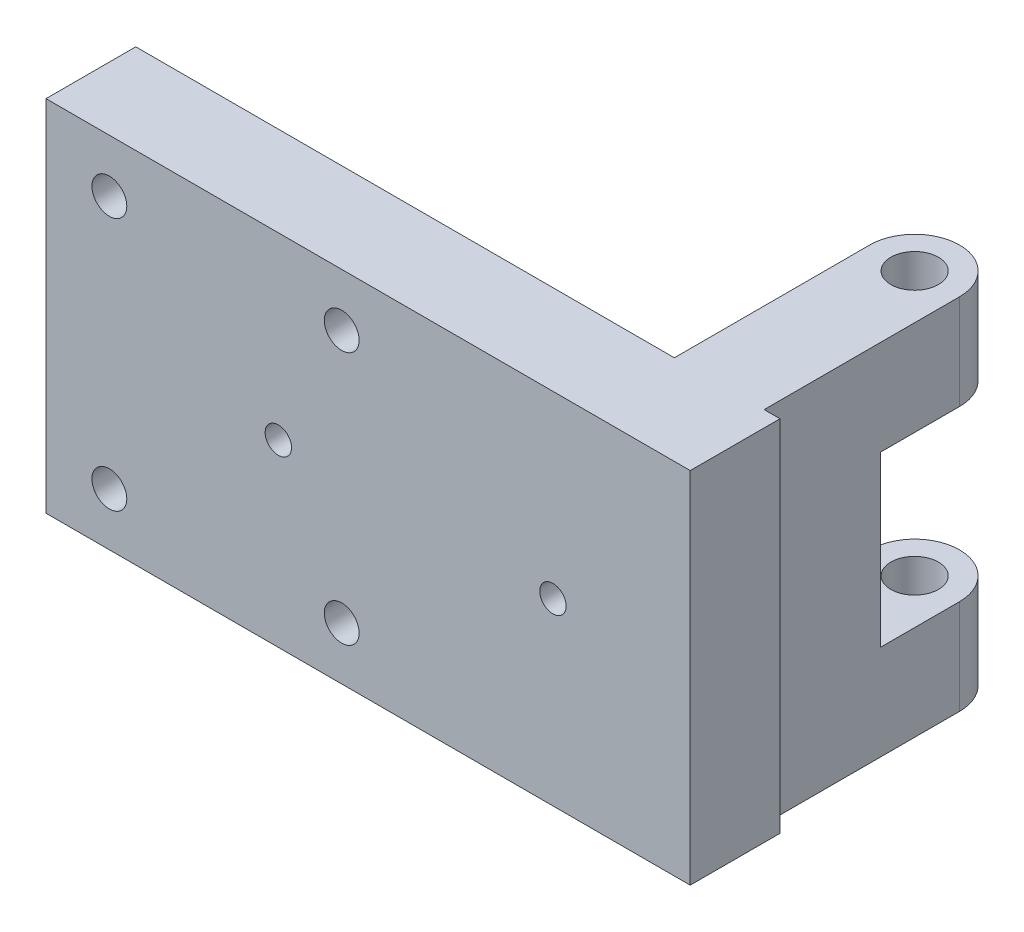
ISO-10303-21;
HEADER;
FILE_DESCRIPTION(('STEP AP214'),'2;1');
FILE_NAME('part.step','',(''),(''),'','','');
FILE_SCHEMA(('AUTOMOTIVE_DESIGN { 1 0 10303 214 1 1 1 1 }'));
ENDSEC;
DATA;
#1=APPLICATION_CONTEXT('core data for automotive mechanical design processes');
#2=APPLICATION_PROTOCOL_DEFINITION('international standard','automotive_design',2000,#1);
#3=PRODUCT_CONTEXT('',#1,'mechanical');
#4=PRODUCT('Part','Part','',(#3));
#5=PRODUCT_RELATED_PRODUCT_CATEGORY('part','',(#4));
#6=PRODUCT_DEFINITION_FORMATION('','',#4);
#7=PRODUCT_DEFINITION_CONTEXT('part definition',#1,'design');
#8=PRODUCT_DEFINITION('design','',#6,#7);
#9=PRODUCT_DEFINITION_SHAPE('','',#8);
#10=(LENGTH_UNIT() NAMED_UNIT(*) SI_UNIT(.MILLI.,.METRE.));
#11=(NAMED_UNIT(*) PLANE_ANGLE_UNIT() SI_UNIT($,.RADIAN.));
#12=(NAMED_UNIT(*) SI_UNIT($,.STERADIAN.) SOLID_ANGLE_UNIT());
#13=UNCERTAINTY_MEASURE_WITH_UNIT(LENGTH_MEASURE(1.E-05),#10,'distance_accuracy_value','');
#14=(GEOMETRIC_REPRESENTATION_CONTEXT(3) GLOBAL_UNCERTAINTY_ASSIGNED_CONTEXT((#13)) GLOBAL_UNIT_ASSIGNED_CONTEXT((#10,
#11,#12)) REPRESENTATION_CONTEXT('',''));
#15=CARTESIAN_POINT('',(0.,0.,0.));
#16=DIRECTION('',(0.,0.,1.));
#17=DIRECTION('',(1.,0.,0.));
#18=AXIS2_PLACEMENT_3D('',#15,#16,#17);
#19=CARTESIAN_POINT('',(0.,68.,0.));
#20=DIRECTION('',(0.,0.,-1.));
#21=DIRECTION('',(-1.,0.,0.));
#22=AXIS2_PLACEMENT_3D('',#19,#20,#21);
#23=PLANE('',#22);
#24=CARTESIAN_POINT('',(44.,34.,0.));
#25=DIRECTION('',(0.,0.,1.));
#26=DIRECTION('',(1.,0.,0.));
#27=AXIS2_PLACEMENT_3D('',#24,#25,#26);
#28=CIRCLE('',#27,2.5);
#29=CARTESIAN_POINT('',(46.5,34.,0.));
#30=VERTEX_POINT('',#29);
#31=EDGE_CURVE('E186',#30,#30,#28,.T.);
#32=ORIENTED_EDGE('',*,*,#31,.T.);
#33=EDGE_LOOP('',(#32));
#34=FACE_BOUND('',#33,.T.);
#35=CARTESIAN_POINT('',(96.,34.,0.));
#36=DIRECTION('',(0.,0.,1.));
#37=DIRECTION('',(1.,0.,0.));
#38=AXIS2_PLACEMENT_3D('',#35,#36,#37);
#39=CIRCLE('',#38,2.5);
#40=CARTESIAN_POINT('',(98.5,34.,0.));
#41=VERTEX_POINT('',#40);
#42=EDGE_CURVE('E307',#41,#41,#39,.T.);
#43=ORIENTED_EDGE('',*,*,#42,.T.);
#44=EDGE_LOOP('',(#43));
#45=FACE_BOUND('',#44,.T.);
#46=CARTESIAN_POINT('',(12.,58.,0.));
#47=DIRECTION('',(0.,0.,1.));
#48=DIRECTION('',(1.,0.,0.));
#49=AXIS2_PLACEMENT_3D('',#46,#47,#48);
#50=CIRCLE('',#49,3.3);
#51=CARTESIAN_POINT('',(15.3,58.,0.));
#52=VERTEX_POINT('',#51);
#53=EDGE_CURVE('E301',#52,#52,#50,.T.);
#54=ORIENTED_EDGE('',*,*,#53,.T.);
#55=EDGE_LOOP('',(#54));
#56=FACE_BOUND('',#55,.T.);
#57=CARTESIAN_POINT('',(56.,58.,0.));
#58=DIRECTION('',(0.,0.,1.));
#59=DIRECTION('',(1.,0.,0.));
#60=AXIS2_PLACEMENT_3D('',#57,#58,#59);
#61=CIRCLE('',#60,3.3);
#62=CARTESIAN_POINT('',(59.3,58.,0.));
#63=VERTEX_POINT('',#62);
#64=EDGE_CURVE('E295',#63,#63,#61,.T.);
#65=ORIENTED_EDGE('',*,*,#64,.T.);
#66=EDGE_LOOP('',(#65));
#67=FACE_BOUND('',#66,.T.);
#68=CARTESIAN_POINT('',(56.,10.,0.));
#69=DIRECTION('',(0.,0.,1.));
#70=DIRECTION('',(1.,0.,0.));
#71=AXIS2_PLACEMENT_3D('',#68,#69,#70);
#72=CIRCLE('',#71,3.3);
#73=CARTESIAN_POINT('',(59.3,10.,0.));
#74=VERTEX_POINT('',#73);
#75=EDGE_CURVE('E289',#74,#74,#72,.T.);
#76=ORIENTED_EDGE('',*,*,#75,.T.);
#77=EDGE_LOOP('',(#76));
#78=FACE_BOUND('',#77,.T.);
#79=CARTESIAN_POINT('',(12.,10.,0.));
#80=DIRECTION('',(0.,0.,1.));
#81=DIRECTION('',(1.,0.,0.));
#82=AXIS2_PLACEMENT_3D('',#79,#80,#81);
#83=CIRCLE('',#82,3.3);
#84=CARTESIAN_POINT('',(15.3,10.,0.));
#85=VERTEX_POINT('',#84);
#86=EDGE_CURVE('E283',#85,#85,#83,.T.);
#87=ORIENTED_EDGE('',*,*,#86,.T.);
#88=EDGE_LOOP('',(#87));
#89=FACE_BOUND('',#88,.T.);
#90=DIRECTION('',(-1.,0.,0.));
#91=VECTOR('',#90,1.);
#92=CARTESIAN_POINT('',(0.,68.,0.));
#93=LINE('',#92,#91);
#94=CARTESIAN_POINT('',(102.,68.,0.));
#95=VERTEX_POINT('',#94);
#96=CARTESIAN_POINT('',(0.,68.,0.));
#97=VERTEX_POINT('',#96);
#98=EDGE_CURVE('E225',#95,#97,#93,.T.);
#99=ORIENTED_EDGE('',*,*,#98,.F.);
#100=DIRECTION('',(0.,-1.,0.));
#101=VECTOR('',#100,1.);
#102=CARTESIAN_POINT('',(102.,18.,0.));
#103=LINE('',#102,#101);
#104=CARTESIAN_POINT('',(102.,0.,0.));
#105=VERTEX_POINT('',#104);
#106=EDGE_CURVE('E175',#95,#105,#103,.T.);
#107=ORIENTED_EDGE('',*,*,#106,.T.);
#108=DIRECTION('',(1.,0.,0.));
#109=VECTOR('',#108,1.);
#110=CARTESIAN_POINT('',(0.,0.,0.));
#111=LINE('',#110,#109);
#112=CARTESIAN_POINT('',(0.,0.,0.));
#113=VERTEX_POINT('',#112);
#114=EDGE_CURVE('E212',#113,#105,#111,.T.);
#115=ORIENTED_EDGE('',*,*,#114,.F.);
#116=DIRECTION('',(0.,-1.,0.));
#117=VECTOR('',#116,1.);
#118=CARTESIAN_POINT('',(0.,0.,0.));
#119=LINE('',#118,#117);
#120=EDGE_CURVE('E213',#97,#113,#119,.T.);
#121=ORIENTED_EDGE('',*,*,#120,.F.);
#122=EDGE_LOOP('',(#99,#107,#115,#121));
#123=FACE_BOUND('',#122,.T.);
#124=ADVANCED_FACE('F30',(#34,#45,#56,#67,#78,#89,#123),#23,.T.);
#125=DIRECTION('',(0.,-1.,0.));
#126=VECTOR('',#125,1.);
#127=CARTESIAN_POINT('',(119.,18.,0.));
#128=LINE('',#127,#126);
#129=CARTESIAN_POINT('',(119.,68.,0.));
#130=VERTEX_POINT('',#129);
#131=CARTESIAN_POINT('',(119.,0.,0.));
#132=VERTEX_POINT('',#131);
#133=EDGE_CURVE('E181',#130,#132,#128,.T.);
#134=ORIENTED_EDGE('',*,*,#133,.F.);
#135=CARTESIAN_POINT('',(122.,68.,0.));
#136=VERTEX_POINT('',#135);
#137=EDGE_CURVE('E226',#136,#130,#93,.T.);
#138=ORIENTED_EDGE('',*,*,#137,.F.);
#139=DIRECTION('',(0.,1.,0.));
#140=VECTOR('',#139,1.);
#141=CARTESIAN_POINT('',(122.,0.,0.));
#142=LINE('',#141,#140);
#143=CARTESIAN_POINT('',(122.,0.,0.));
#144=VERTEX_POINT('',#143);
#145=EDGE_CURVE('E211',#144,#136,#142,.T.);
#146=ORIENTED_EDGE('',*,*,#145,.F.);
#147=EDGE_CURVE('E203',#132,#144,#111,.T.);
#148=ORIENTED_EDGE('',*,*,#147,.F.);
#149=EDGE_LOOP('',(#134,#138,#146,#148));
#150=FACE_BOUND('',#149,.T.);
#151=ADVANCED_FACE('F209',(#150),#23,.T.);
#152=CARTESIAN_POINT('',(0.,0.,17.));
#153=DIRECTION('',(1.,0.,0.));
#154=DIRECTION('',(0.,0.,-1.));
#155=AXIS2_PLACEMENT_3D('',#152,#153,#154);
#156=PLANE('',#155);
#157=ORIENTED_EDGE('',*,*,#120,.T.);
#158=DIRECTION('',(0.,0.,-1.));
#159=VECTOR('',#158,1.);
#160=CARTESIAN_POINT('',(0.,0.,17.));
#161=LINE('',#160,#159);
#162=CARTESIAN_POINT('',(0.,0.,17.));
#163=VERTEX_POINT('',#162);
#164=EDGE_CURVE('E11',#163,#113,#161,.T.);
#165=ORIENTED_EDGE('',*,*,#164,.F.);
#166=DIRECTION('',(0.,-1.,0.));
#167=VECTOR('',#166,1.);
#168=CARTESIAN_POINT('',(0.,0.,17.));
#169=LINE('',#168,#167);
#170=CARTESIAN_POINT('',(0.,68.,17.));
#171=VERTEX_POINT('',#170);
#172=EDGE_CURVE('E229',#171,#163,#169,.T.);
#173=ORIENTED_EDGE('',*,*,#172,.F.);
#174=DIRECTION('',(0.,0.,-1.));
#175=VECTOR('',#174,1.);
#176=CARTESIAN_POINT('',(0.,68.,17.));
#177=LINE('',#176,#175);
#178=EDGE_CURVE('E230',#171,#97,#177,.T.);
#179=ORIENTED_EDGE('',*,*,#178,.T.);
#180=EDGE_LOOP('',(#157,#165,#173,#179));
#181=FACE_BOUND('',#180,.T.);
#182=ADVANCED_FACE('F32',(#181),#156,.F.);
#183=CARTESIAN_POINT('',(0.,0.,17.));
#184=DIRECTION('',(0.,1.,0.));
#185=DIRECTION('',(0.,0.,1.));
#186=AXIS2_PLACEMENT_3D('',#183,#184,#185);
#187=PLANE('',#186);
#188=ORIENTED_EDGE('',*,*,#114,.T.);
#189=DIRECTION('',(0.,0.,-1.));
#190=VECTOR('',#189,1.);
#191=CARTESIAN_POINT('',(102.,0.,0.));
#192=LINE('',#191,#190);
#193=CARTESIAN_POINT('',(102.,0.,-37.));
#194=VERTEX_POINT('',#193);
#195=EDGE_CURVE('E165',#105,#194,#192,.T.);
#196=ORIENTED_EDGE('',*,*,#195,.T.);
#197=CARTESIAN_POINT('',(110.5,0.,-37.));
#198=DIRECTION('',(0.,-1.,0.));
#199=DIRECTION('',(0.,0.,1.));
#200=AXIS2_PLACEMENT_3D('',#197,#198,#199);
#201=CIRCLE('',#200,8.49999999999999);
#202=CARTESIAN_POINT('',(119.,0.,-37.));
#203=VERTEX_POINT('',#202);
#204=EDGE_CURVE('E176',#194,#203,#201,.T.);
#205=ORIENTED_EDGE('',*,*,#204,.T.);
#206=DIRECTION('',(0.,0.,1.));
#207=VECTOR('',#206,1.);
#208=CARTESIAN_POINT('',(119.,0.,0.));
#209=LINE('',#208,#207);
#210=EDGE_CURVE('E170',#203,#132,#209,.T.);
#211=ORIENTED_EDGE('',*,*,#210,.T.);
#212=ORIENTED_EDGE('',*,*,#147,.T.);
#213=DIRECTION('',(0.,0.,-1.));
#214=VECTOR('',#213,1.);
#215=CARTESIAN_POINT('',(122.,0.,17.));
#216=LINE('',#215,#214);
#217=CARTESIAN_POINT('',(122.,0.,17.));
#218=VERTEX_POINT('',#217);
#219=EDGE_CURVE('E39',#218,#144,#216,.T.);
#220=ORIENTED_EDGE('',*,*,#219,.F.);
#221=DIRECTION('',(1.,0.,0.));
#222=VECTOR('',#221,1.);
#223=CARTESIAN_POINT('',(0.,0.,17.));
#224=LINE('',#223,#222);
#225=EDGE_CURVE('E242',#163,#218,#224,.T.);
#226=ORIENTED_EDGE('',*,*,#225,.F.);
#227=ORIENTED_EDGE('',*,*,#164,.T.);
#228=EDGE_LOOP('',(#188,#196,#205,#211,#212,#220,#226,#227));
#229=FACE_BOUND('',#228,.T.);
#230=CARTESIAN_POINT('',(110.5,0.,-37.));
#231=DIRECTION('',(0.,-1.,0.));
#232=DIRECTION('',(0.,0.,-1.));
#233=AXIS2_PLACEMENT_3D('',#230,#231,#232);
#234=CIRCLE('',#233,4.50000000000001);
#235=CARTESIAN_POINT('',(110.5,0.,-41.5));
#236=VERTEX_POINT('',#235);
#237=EDGE_CURVE('E160',#236,#236,#234,.T.);
#238=ORIENTED_EDGE('',*,*,#237,.F.);
#239=EDGE_LOOP('',(#238));
#240=FACE_BOUND('',#239,.T.);
#241=ADVANCED_FACE('F200',(#229,#240),#187,.F.);
#242=CARTESIAN_POINT('',(122.,0.,17.));
#243=DIRECTION('',(-1.,0.,0.));
#244=DIRECTION('',(0.,0.,1.));
#245=AXIS2_PLACEMENT_3D('',#242,#243,#244);
#246=PLANE('',#245);
#247=ORIENTED_EDGE('',*,*,#145,.T.);
#248=DIRECTION('',(0.,0.,-1.));
#249=VECTOR('',#248,1.);
#250=CARTESIAN_POINT('',(122.,68.,17.));
#251=LINE('',#250,#249);
#252=CARTESIAN_POINT('',(122.,68.,17.));
#253=VERTEX_POINT('',#252);
#254=EDGE_CURVE('E233',#253,#136,#251,.T.);
#255=ORIENTED_EDGE('',*,*,#254,.F.);
#256=DIRECTION('',(0.,1.,0.));
#257=VECTOR('',#256,1.);
#258=CARTESIAN_POINT('',(122.,0.,17.));
#259=LINE('',#258,#257);
#260=EDGE_CURVE('E241',#218,#253,#259,.T.);
#261=ORIENTED_EDGE('',*,*,#260,.F.);
#262=ORIENTED_EDGE('',*,*,#219,.T.);
#263=EDGE_LOOP('',(#247,#255,#261,#262));
#264=FACE_BOUND('',#263,.T.);
#265=ADVANCED_FACE('F239',(#264),#246,.F.);
#266=CARTESIAN_POINT('',(0.,68.,17.));
#267=DIRECTION('',(0.,-1.,0.));
#268=DIRECTION('',(0.,0.,-1.));
#269=AXIS2_PLACEMENT_3D('',#266,#267,#268);
#270=PLANE('',#269);
#271=ORIENTED_EDGE('',*,*,#137,.T.);
#272=DIRECTION('',(0.,0.,1.));
#273=VECTOR('',#272,1.);
#274=CARTESIAN_POINT('',(119.,68.,0.));
#275=LINE('',#274,#273);
#276=CARTESIAN_POINT('',(119.,68.,-37.));
#277=VERTEX_POINT('',#276);
#278=EDGE_CURVE('E156',#277,#130,#275,.T.);
#279=ORIENTED_EDGE('',*,*,#278,.F.);
#280=CARTESIAN_POINT('',(110.5,68.,-37.));
#281=DIRECTION('',(0.,-1.,0.));
#282=DIRECTION('',(0.,0.,1.));
#283=AXIS2_PLACEMENT_3D('',#280,#281,#282);
#284=CIRCLE('',#283,8.49999999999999);
#285=CARTESIAN_POINT('',(102.,68.,-37.));
#286=VERTEX_POINT('',#285);
#287=EDGE_CURVE('E137',#286,#277,#284,.T.);
#288=ORIENTED_EDGE('',*,*,#287,.F.);
#289=DIRECTION('',(0.,0.,-1.));
#290=VECTOR('',#289,1.);
#291=CARTESIAN_POINT('',(102.,68.,0.));
#292=LINE('',#291,#290);
#293=EDGE_CURVE('E148',#95,#286,#292,.T.);
#294=ORIENTED_EDGE('',*,*,#293,.F.);
#295=ORIENTED_EDGE('',*,*,#98,.T.);
#296=ORIENTED_EDGE('',*,*,#178,.F.);
#297=DIRECTION('',(-1.,0.,0.));
#298=VECTOR('',#297,1.);
#299=CARTESIAN_POINT('',(0.,68.,17.));
#300=LINE('',#299,#298);
#301=EDGE_CURVE('E234',#253,#171,#300,.T.);
#302=ORIENTED_EDGE('',*,*,#301,.F.);
#303=ORIENTED_EDGE('',*,*,#254,.T.);
#304=EDGE_LOOP('',(#271,#279,#288,#294,#295,#296,#302,#303));
#305=FACE_BOUND('',#304,.T.);
#306=CARTESIAN_POINT('',(110.5,68.,-37.));
#307=DIRECTION('',(0.,-1.,0.));
#308=DIRECTION('',(0.,0.,-1.));
#309=AXIS2_PLACEMENT_3D('',#306,#307,#308);
#310=CIRCLE('',#309,4.50000000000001);
#311=CARTESIAN_POINT('',(110.5,68.,-41.5));
#312=VERTEX_POINT('',#311);
#313=EDGE_CURVE('E152',#312,#312,#310,.T.);
#314=ORIENTED_EDGE('',*,*,#313,.T.);
#315=EDGE_LOOP('',(#314));
#316=FACE_BOUND('',#315,.T.);
#317=ADVANCED_FACE('F278',(#305,#316),#270,.F.);
#318=CARTESIAN_POINT('',(0.,68.,17.));
#319=DIRECTION('',(0.,0.,-1.));
#320=DIRECTION('',(-1.,0.,0.));
#321=AXIS2_PLACEMENT_3D('',#318,#319,#320);
#322=PLANE('',#321);
#323=CARTESIAN_POINT('',(44.,34.,17.));
#324=DIRECTION('',(0.,0.,1.));
#325=DIRECTION('',(1.,0.,0.));
#326=AXIS2_PLACEMENT_3D('',#323,#324,#325);
#327=CIRCLE('',#326,2.49999999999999);
#328=CARTESIAN_POINT('',(46.5,34.,17.));
#329=VERTEX_POINT('',#328);
#330=EDGE_CURVE('E309',#329,#329,#327,.T.);
#331=ORIENTED_EDGE('',*,*,#330,.F.);
#332=EDGE_LOOP('',(#331));
#333=FACE_BOUND('',#332,.T.);
#334=CARTESIAN_POINT('',(96.,34.,17.));
#335=DIRECTION('',(0.,0.,1.));
#336=DIRECTION('',(1.,0.,0.));
#337=AXIS2_PLACEMENT_3D('',#334,#335,#336);
#338=CIRCLE('',#337,2.49999999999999);
#339=CARTESIAN_POINT('',(98.5,34.,17.));
#340=VERTEX_POINT('',#339);
#341=EDGE_CURVE('E304',#340,#340,#338,.T.);
#342=ORIENTED_EDGE('',*,*,#341,.F.);
#343=EDGE_LOOP('',(#342));
#344=FACE_BOUND('',#343,.T.);
#345=CARTESIAN_POINT('',(12.,58.,17.));
#346=DIRECTION('',(0.,0.,1.));
#347=DIRECTION('',(1.,0.,0.));
#348=AXIS2_PLACEMENT_3D('',#345,#346,#347);
#349=CIRCLE('',#348,3.29999999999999);
#350=CARTESIAN_POINT('',(15.3,58.,17.));
#351=VERTEX_POINT('',#350);
#352=EDGE_CURVE('E298',#351,#351,#349,.T.);
#353=ORIENTED_EDGE('',*,*,#352,.F.);
#354=EDGE_LOOP('',(#353));
#355=FACE_BOUND('',#354,.T.);
#356=CARTESIAN_POINT('',(56.,58.,17.));
#357=DIRECTION('',(0.,0.,1.));
#358=DIRECTION('',(1.,0.,0.));
#359=AXIS2_PLACEMENT_3D('',#356,#357,#358);
#360=CIRCLE('',#359,3.29999999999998);
#361=CARTESIAN_POINT('',(59.3,58.,17.));
#362=VERTEX_POINT('',#361);
#363=EDGE_CURVE('E292',#362,#362,#360,.T.);
#364=ORIENTED_EDGE('',*,*,#363,.F.);
#365=EDGE_LOOP('',(#364));
#366=FACE_BOUND('',#365,.T.);
#367=CARTESIAN_POINT('',(56.,10.,17.));
#368=DIRECTION('',(0.,0.,1.));
#369=DIRECTION('',(1.,0.,0.));
#370=AXIS2_PLACEMENT_3D('',#367,#368,#369);
#371=CIRCLE('',#370,3.29999999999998);
#372=CARTESIAN_POINT('',(59.3,10.,17.));
#373=VERTEX_POINT('',#372);
#374=EDGE_CURVE('E286',#373,#373,#371,.T.);
#375=ORIENTED_EDGE('',*,*,#374,.F.);
#376=EDGE_LOOP('',(#375));
#377=FACE_BOUND('',#376,.T.);
#378=CARTESIAN_POINT('',(12.,10.,17.));
#379=DIRECTION('',(0.,0.,1.));
#380=DIRECTION('',(1.,0.,0.));
#381=AXIS2_PLACEMENT_3D('',#378,#379,#380);
#382=CIRCLE('',#381,3.29999999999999);
#383=CARTESIAN_POINT('',(15.3,10.,17.));
#384=VERTEX_POINT('',#383);
#385=EDGE_CURVE('E217',#384,#384,#382,.T.);
#386=ORIENTED_EDGE('',*,*,#385,.F.);
#387=EDGE_LOOP('',(#386));
#388=FACE_BOUND('',#387,.T.);
#389=ORIENTED_EDGE('',*,*,#172,.T.);
#390=ORIENTED_EDGE('',*,*,#225,.T.);
#391=ORIENTED_EDGE('',*,*,#260,.T.);
#392=ORIENTED_EDGE('',*,*,#301,.T.);
#393=EDGE_LOOP('',(#389,#390,#391,#392));
#394=FACE_BOUND('',#393,.T.);
#395=ADVANCED_FACE('F248',(#333,#344,#355,#366,#377,#388,#394),#322,.F.);
#396=CARTESIAN_POINT('',(12.,10.,17.));
#397=DIRECTION('',(0.,0.,1.));
#398=DIRECTION('',(1.,0.,0.));
#399=AXIS2_PLACEMENT_3D('',#396,#397,#398);
#400=CYLINDRICAL_SURFACE('',#399,3.29999999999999);
#401=ORIENTED_EDGE('',*,*,#86,.F.);
#402=EDGE_LOOP('',(#401));
#403=FACE_BOUND('',#402,.T.);
#404=ORIENTED_EDGE('',*,*,#385,.T.);
#405=EDGE_LOOP('',(#404));
#406=FACE_BOUND('',#405,.T.);
#407=ADVANCED_FACE('F463',(#403,#406),#400,.F.);
#408=CARTESIAN_POINT('',(56.,10.,17.));
#409=DIRECTION('',(0.,0.,1.));
#410=DIRECTION('',(1.,0.,0.));
#411=AXIS2_PLACEMENT_3D('',#408,#409,#410);
#412=CYLINDRICAL_SURFACE('',#411,3.29999999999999);
#413=ORIENTED_EDGE('',*,*,#75,.F.);
#414=EDGE_LOOP('',(#413));
#415=FACE_BOUND('',#414,.T.);
#416=ORIENTED_EDGE('',*,*,#374,.T.);
#417=EDGE_LOOP('',(#416));
#418=FACE_BOUND('',#417,.T.);
#419=ADVANCED_FACE('F482',(#415,#418),#412,.F.);
#420=CARTESIAN_POINT('',(56.,58.,17.));
#421=DIRECTION('',(0.,0.,1.));
#422=DIRECTION('',(1.,0.,0.));
#423=AXIS2_PLACEMENT_3D('',#420,#421,#422);
#424=CYLINDRICAL_SURFACE('',#423,3.29999999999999);
#425=ORIENTED_EDGE('',*,*,#64,.F.);
#426=EDGE_LOOP('',(#425));
#427=FACE_BOUND('',#426,.T.);
#428=ORIENTED_EDGE('',*,*,#363,.T.);
#429=EDGE_LOOP('',(#428));
#430=FACE_BOUND('',#429,.T.);
#431=ADVANCED_FACE('F472',(#427,#430),#424,.F.);
#432=CARTESIAN_POINT('',(12.,58.,17.));
#433=DIRECTION('',(0.,0.,1.));
#434=DIRECTION('',(1.,0.,0.));
#435=AXIS2_PLACEMENT_3D('',#432,#433,#434);
#436=CYLINDRICAL_SURFACE('',#435,3.29999999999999);
#437=ORIENTED_EDGE('',*,*,#53,.F.);
#438=EDGE_LOOP('',(#437));
#439=FACE_BOUND('',#438,.T.);
#440=ORIENTED_EDGE('',*,*,#352,.T.);
#441=EDGE_LOOP('',(#440));
#442=FACE_BOUND('',#441,.T.);
#443=ADVANCED_FACE('F327',(#439,#442),#436,.F.);
#444=CARTESIAN_POINT('',(96.,34.,17.));
#445=DIRECTION('',(0.,0.,1.));
#446=DIRECTION('',(1.,0.,0.));
#447=AXIS2_PLACEMENT_3D('',#444,#445,#446);
#448=CYLINDRICAL_SURFACE('',#447,2.5);
#449=ORIENTED_EDGE('',*,*,#42,.F.);
#450=EDGE_LOOP('',(#449));
#451=FACE_BOUND('',#450,.T.);
#452=ORIENTED_EDGE('',*,*,#341,.T.);
#453=EDGE_LOOP('',(#452));
#454=FACE_BOUND('',#453,.T.);
#455=ADVANCED_FACE('F320',(#451,#454),#448,.F.);
#456=CARTESIAN_POINT('',(44.,34.,17.));
#457=DIRECTION('',(0.,0.,1.));
#458=DIRECTION('',(1.,0.,0.));
#459=AXIS2_PLACEMENT_3D('',#456,#457,#458);
#460=CYLINDRICAL_SURFACE('',#459,2.49999999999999);
#461=ORIENTED_EDGE('',*,*,#31,.F.);
#462=EDGE_LOOP('',(#461));
#463=FACE_BOUND('',#462,.T.);
#464=ORIENTED_EDGE('',*,*,#330,.T.);
#465=EDGE_LOOP('',(#464));
#466=FACE_BOUND('',#465,.T.);
#467=ADVANCED_FACE('F318',(#463,#466),#460,.F.);
#468=CARTESIAN_POINT('',(119.,18.,0.));
#469=DIRECTION('',(1.,0.,0.));
#470=DIRECTION('',(0.,0.,-1.));
#471=AXIS2_PLACEMENT_3D('',#468,#469,#470);
#472=PLANE('',#471);
#473=ORIENTED_EDGE('',*,*,#210,.F.);
#474=DIRECTION('',(0.,-1.,0.));
#475=VECTOR('',#474,1.);
#476=CARTESIAN_POINT('',(119.,18.,-37.));
#477=LINE('',#476,#475);
#478=CARTESIAN_POINT('',(119.,18.,-37.));
#479=VERTEX_POINT('',#478);
#480=EDGE_CURVE('E179',#479,#203,#477,.T.);
#481=ORIENTED_EDGE('',*,*,#480,.F.);
#482=DIRECTION('',(0.,0.,1.));
#483=VECTOR('',#482,1.);
#484=CARTESIAN_POINT('',(119.,18.,0.));
#485=LINE('',#484,#483);
#486=CARTESIAN_POINT('',(119.,18.,-22.));
#487=VERTEX_POINT('',#486);
#488=EDGE_CURVE('E173',#479,#487,#485,.T.);
#489=ORIENTED_EDGE('',*,*,#488,.T.);
#490=DIRECTION('',(0.,1.,0.));
#491=VECTOR('',#490,1.);
#492=CARTESIAN_POINT('',(119.,50.,-22.));
#493=LINE('',#492,#491);
#494=CARTESIAN_POINT('',(119.,50.,-22.));
#495=VERTEX_POINT('',#494);
#496=EDGE_CURVE('E147',#487,#495,#493,.T.);
#497=ORIENTED_EDGE('',*,*,#496,.T.);
#498=DIRECTION('',(0.,0.,1.));
#499=VECTOR('',#498,1.);
#500=CARTESIAN_POINT('',(119.,50.,0.));
#501=LINE('',#500,#499);
#502=CARTESIAN_POINT('',(119.,50.,-37.));
#503=VERTEX_POINT('',#502);
#504=EDGE_CURVE('E125',#503,#495,#501,.T.);
#505=ORIENTED_EDGE('',*,*,#504,.F.);
#506=DIRECTION('',(0.,1.,0.));
#507=VECTOR('',#506,1.);
#508=CARTESIAN_POINT('',(119.,50.,-37.));
#509=LINE('',#508,#507);
#510=EDGE_CURVE('E134',#503,#277,#509,.T.);
#511=ORIENTED_EDGE('',*,*,#510,.T.);
#512=ORIENTED_EDGE('',*,*,#278,.T.);
#513=ORIENTED_EDGE('',*,*,#133,.T.);
#514=EDGE_LOOP('',(#473,#481,#489,#497,#505,#511,#512,#513));
#515=FACE_BOUND('',#514,.T.);
#516=ADVANCED_FACE('F145',(#515),#472,.T.);
#517=CARTESIAN_POINT('',(110.5,18.,-37.));
#518=DIRECTION('',(0.,-1.,0.));
#519=DIRECTION('',(0.,0.,-1.));
#520=AXIS2_PLACEMENT_3D('',#517,#518,#519);
#521=CYLINDRICAL_SURFACE('',#520,8.49999999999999);
#522=ORIENTED_EDGE('',*,*,#204,.F.);
#523=DIRECTION('',(0.,-1.,0.));
#524=VECTOR('',#523,1.);
#525=CARTESIAN_POINT('',(102.,18.,-37.));
#526=LINE('',#525,#524);
#527=CARTESIAN_POINT('',(102.,18.,-37.));
#528=VERTEX_POINT('',#527);
#529=EDGE_CURVE('E182',#528,#194,#526,.T.);
#530=ORIENTED_EDGE('',*,*,#529,.F.);
#531=CARTESIAN_POINT('',(110.5,18.,-37.));
#532=DIRECTION('',(0.,-1.,0.));
#533=DIRECTION('',(0.,0.,1.));
#534=AXIS2_PLACEMENT_3D('',#531,#532,#533);
#535=CIRCLE('',#534,8.49999999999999);
#536=EDGE_CURVE('E169',#528,#479,#535,.T.);
#537=ORIENTED_EDGE('',*,*,#536,.T.);
#538=ORIENTED_EDGE('',*,*,#480,.T.);
#539=EDGE_LOOP('',(#522,#530,#537,#538));
#540=FACE_BOUND('',#539,.T.);
#541=ADVANCED_FACE('F261',(#540),#521,.T.);
#542=CARTESIAN_POINT('',(102.,18.,0.));
#543=DIRECTION('',(-1.,0.,0.));
#544=DIRECTION('',(0.,0.,1.));
#545=AXIS2_PLACEMENT_3D('',#542,#543,#544);
#546=PLANE('',#545);
#547=ORIENTED_EDGE('',*,*,#195,.F.);
#548=ORIENTED_EDGE('',*,*,#106,.F.);
#549=ORIENTED_EDGE('',*,*,#293,.T.);
#550=DIRECTION('',(0.,1.,0.));
#551=VECTOR('',#550,1.);
#552=CARTESIAN_POINT('',(102.,50.,-37.));
#553=LINE('',#552,#551);
#554=CARTESIAN_POINT('',(102.,50.,-37.));
#555=VERTEX_POINT('',#554);
#556=EDGE_CURVE('E141',#555,#286,#553,.T.);
#557=ORIENTED_EDGE('',*,*,#556,.F.);
#558=DIRECTION('',(0.,0.,-1.));
#559=VECTOR('',#558,1.);
#560=CARTESIAN_POINT('',(102.,50.,0.));
#561=LINE('',#560,#559);
#562=CARTESIAN_POINT('',(102.,50.,-22.));
#563=VERTEX_POINT('',#562);
#564=EDGE_CURVE('E128',#563,#555,#561,.T.);
#565=ORIENTED_EDGE('',*,*,#564,.F.);
#566=DIRECTION('',(0.,-1.,0.));
#567=VECTOR('',#566,1.);
#568=CARTESIAN_POINT('',(102.,50.,-22.));
#569=LINE('',#568,#567);
#570=CARTESIAN_POINT('',(102.,18.,-22.));
#571=VERTEX_POINT('',#570);
#572=EDGE_CURVE('E270',#563,#571,#569,.T.);
#573=ORIENTED_EDGE('',*,*,#572,.T.);
#574=DIRECTION('',(0.,0.,-1.));
#575=VECTOR('',#574,1.);
#576=CARTESIAN_POINT('',(102.,18.,0.));
#577=LINE('',#576,#575);
#578=EDGE_CURVE('E47',#571,#528,#577,.T.);
#579=ORIENTED_EDGE('',*,*,#578,.T.);
#580=ORIENTED_EDGE('',*,*,#529,.T.);
#581=EDGE_LOOP('',(#547,#548,#549,#557,#565,#573,#579,#580));
#582=FACE_BOUND('',#581,.T.);
#583=ADVANCED_FACE('F257',(#582),#546,.T.);
#584=CARTESIAN_POINT('',(110.5,18.,-37.));
#585=DIRECTION('',(0.,1.,0.));
#586=DIRECTION('',(0.,0.,1.));
#587=AXIS2_PLACEMENT_3D('',#584,#585,#586);
#588=PLANE('',#587);
#589=DIRECTION('',(1.,0.,0.));
#590=VECTOR('',#589,1.);
#591=CARTESIAN_POINT('',(63.1670243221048,18.,-22.));
#592=LINE('',#591,#590);
#593=EDGE_CURVE('E52',#571,#487,#592,.T.);
#594=ORIENTED_EDGE('',*,*,#593,.T.);
#595=ORIENTED_EDGE('',*,*,#488,.F.);
#596=ORIENTED_EDGE('',*,*,#536,.F.);
#597=ORIENTED_EDGE('',*,*,#578,.F.);
#598=EDGE_LOOP('',(#594,#595,#596,#597));
#599=FACE_BOUND('',#598,.T.);
#600=CARTESIAN_POINT('',(110.5,18.,-37.));
#601=DIRECTION('',(0.,-1.,0.));
#602=DIRECTION('',(0.,0.,-1.));
#603=AXIS2_PLACEMENT_3D('',#600,#601,#602);
#604=CIRCLE('',#603,4.50000000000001);
#605=CARTESIAN_POINT('',(110.5,18.,-41.5));
#606=VERTEX_POINT('',#605);
#607=EDGE_CURVE('E162',#606,#606,#604,.T.);
#608=ORIENTED_EDGE('',*,*,#607,.T.);
#609=EDGE_LOOP('',(#608));
#610=FACE_BOUND('',#609,.T.);
#611=ADVANCED_FACE('F375',(#599,#610),#588,.T.);
#612=CARTESIAN_POINT('',(110.5,18.,-37.));
#613=DIRECTION('',(0.,-1.,0.));
#614=DIRECTION('',(0.,0.,-1.));
#615=AXIS2_PLACEMENT_3D('',#612,#613,#614);
#616=CYLINDRICAL_SURFACE('',#615,4.50000000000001);
#617=ORIENTED_EDGE('',*,*,#607,.F.);
#618=EDGE_LOOP('',(#617));
#619=FACE_BOUND('',#618,.T.);
#620=ORIENTED_EDGE('',*,*,#237,.T.);
#621=EDGE_LOOP('',(#620));
#622=FACE_BOUND('',#621,.T.);
#623=ADVANCED_FACE('F385',(#619,#622),#616,.F.);
#624=CARTESIAN_POINT('',(110.5,50.,-37.));
#625=DIRECTION('',(0.,-1.,0.));
#626=DIRECTION('',(0.,0.,1.));
#627=AXIS2_PLACEMENT_3D('',#624,#625,#626);
#628=PLANE('',#627);
#629=DIRECTION('',(1.,0.,0.));
#630=VECTOR('',#629,1.);
#631=CARTESIAN_POINT('',(63.1670243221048,50.,-22.));
#632=LINE('',#631,#630);
#633=EDGE_CURVE('E265',#563,#495,#632,.T.);
#634=ORIENTED_EDGE('',*,*,#633,.F.);
#635=ORIENTED_EDGE('',*,*,#564,.T.);
#636=CARTESIAN_POINT('',(110.5,50.,-37.));
#637=DIRECTION('',(0.,-1.,0.));
#638=DIRECTION('',(0.,0.,1.));
#639=AXIS2_PLACEMENT_3D('',#636,#637,#638);
#640=CIRCLE('',#639,8.49999999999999);
#641=EDGE_CURVE('E120',#555,#503,#640,.T.);
#642=ORIENTED_EDGE('',*,*,#641,.T.);
#643=ORIENTED_EDGE('',*,*,#504,.T.);
#644=EDGE_LOOP('',(#634,#635,#642,#643));
#645=FACE_BOUND('',#644,.T.);
#646=CARTESIAN_POINT('',(110.5,50.,-37.));
#647=DIRECTION('',(0.,-1.,0.));
#648=DIRECTION('',(0.,0.,-1.));
#649=AXIS2_PLACEMENT_3D('',#646,#647,#648);
#650=CIRCLE('',#649,4.50000000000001);
#651=CARTESIAN_POINT('',(110.5,50.,-41.5));
#652=VERTEX_POINT('',#651);
#653=EDGE_CURVE('E158',#652,#652,#650,.T.);
#654=ORIENTED_EDGE('',*,*,#653,.F.);
#655=EDGE_LOOP('',(#654));
#656=FACE_BOUND('',#655,.T.);
#657=ADVANCED_FACE('F122',(#645,#656),#628,.T.);
#658=CARTESIAN_POINT('',(110.5,50.,-37.));
#659=DIRECTION('',(0.,1.,0.));
#660=DIRECTION('',(0.,0.,1.));
#661=AXIS2_PLACEMENT_3D('',#658,#659,#660);
#662=CYLINDRICAL_SURFACE('',#661,8.49999999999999);
#663=ORIENTED_EDGE('',*,*,#287,.T.);
#664=ORIENTED_EDGE('',*,*,#510,.F.);
#665=ORIENTED_EDGE('',*,*,#641,.F.);
#666=ORIENTED_EDGE('',*,*,#556,.T.);
#667=EDGE_LOOP('',(#663,#664,#665,#666));
#668=FACE_BOUND('',#667,.T.);
#669=ADVANCED_FACE('F135',(#668),#662,.T.);
#670=CARTESIAN_POINT('',(110.5,50.,-37.));
#671=DIRECTION('',(0.,1.,0.));
#672=DIRECTION('',(0.,0.,1.));
#673=AXIS2_PLACEMENT_3D('',#670,#671,#672);
#674=CYLINDRICAL_SURFACE('',#673,4.50000000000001);
#675=ORIENTED_EDGE('',*,*,#653,.T.);
#676=EDGE_LOOP('',(#675));
#677=FACE_BOUND('',#676,.T.);
#678=ORIENTED_EDGE('',*,*,#313,.F.);
#679=EDGE_LOOP('',(#678));
#680=FACE_BOUND('',#679,.T.);
#681=ADVANCED_FACE('F404',(#677,#680),#674,.F.);
#682=CARTESIAN_POINT('',(63.1670243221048,50.,-22.));
#683=DIRECTION('',(0.,0.,-1.));
#684=DIRECTION('',(-1.,0.,0.));
#685=AXIS2_PLACEMENT_3D('',#682,#683,#684);
#686=PLANE('',#685);
#687=ORIENTED_EDGE('',*,*,#572,.F.);
#688=ORIENTED_EDGE('',*,*,#633,.T.);
#689=ORIENTED_EDGE('',*,*,#496,.F.);
#690=ORIENTED_EDGE('',*,*,#593,.F.);
#691=EDGE_LOOP('',(#687,#688,#689,#690));
#692=FACE_BOUND('',#691,.T.);
#693=ADVANCED_FACE('F264',(#692),#686,.T.);
#694=CLOSED_SHELL('',(#124,#151,#182,#241,#265,#317,#395,#407,#419,#431,#443,#455,#467,#516,
#541,#583,#611,#623,#657,#669,#681,#693));
#695=MANIFOLD_SOLID_BREP('B2',#694);
#696=ADVANCED_BREP_SHAPE_REPRESENTATION('',(#18,#695),#14);
#697=SHAPE_DEFINITION_REPRESENTATION(#9,#696);
ENDSEC;
END-ISO-10303-21;
